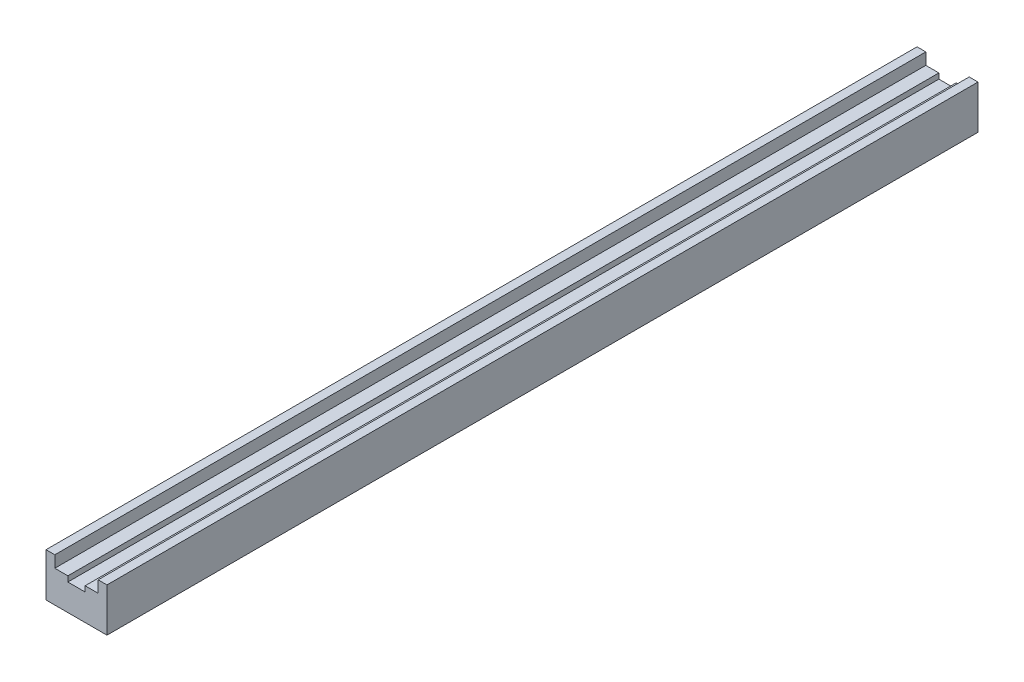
ISO-10303-21;
HEADER;
FILE_DESCRIPTION(('STEP AP214'),'2;1');
FILE_NAME('part.step','',(''),(''),'','','');
FILE_SCHEMA(('AUTOMOTIVE_DESIGN { 1 0 10303 214 1 1 1 1 }'));
ENDSEC;
DATA;
#1=APPLICATION_CONTEXT('core data for automotive mechanical design processes');
#2=APPLICATION_PROTOCOL_DEFINITION('international standard','automotive_design',2000,#1);
#3=PRODUCT_CONTEXT('',#1,'mechanical');
#4=PRODUCT('Part','Part','',(#3));
#5=PRODUCT_RELATED_PRODUCT_CATEGORY('part','',(#4));
#6=PRODUCT_DEFINITION_FORMATION('','',#4);
#7=PRODUCT_DEFINITION_CONTEXT('part definition',#1,'design');
#8=PRODUCT_DEFINITION('design','',#6,#7);
#9=PRODUCT_DEFINITION_SHAPE('','',#8);
#10=(LENGTH_UNIT() NAMED_UNIT(*) SI_UNIT(.MILLI.,.METRE.));
#11=(NAMED_UNIT(*) PLANE_ANGLE_UNIT() SI_UNIT($,.RADIAN.));
#12=(NAMED_UNIT(*) SI_UNIT($,.STERADIAN.) SOLID_ANGLE_UNIT());
#13=UNCERTAINTY_MEASURE_WITH_UNIT(LENGTH_MEASURE(1.E-05),#10,'distance_accuracy_value','');
#14=(GEOMETRIC_REPRESENTATION_CONTEXT(3) GLOBAL_UNCERTAINTY_ASSIGNED_CONTEXT((#13)) GLOBAL_UNIT_ASSIGNED_CONTEXT((#10,
#11,#12)) REPRESENTATION_CONTEXT('',''));
#15=CARTESIAN_POINT('',(0.,0.,0.));
#16=DIRECTION('',(0.,0.,1.));
#17=DIRECTION('',(1.,0.,0.));
#18=AXIS2_PLACEMENT_3D('',#15,#16,#17);
#19=CARTESIAN_POINT('',(-17.5,25.,0.));
#20=DIRECTION('',(-1.,0.,0.));
#21=DIRECTION('',(0.,0.,1.));
#22=AXIS2_PLACEMENT_3D('',#19,#20,#21);
#23=PLANE('',#22);
#24=DIRECTION('',(0.,0.,1.));
#25=VECTOR('',#24,1.);
#26=CARTESIAN_POINT('',(-17.5,25.,0.));
#27=LINE('',#26,#25);
#28=CARTESIAN_POINT('',(-17.5,25.,0.));
#29=VERTEX_POINT('',#28);
#30=CARTESIAN_POINT('',(-17.5,25.,500.));
#31=VERTEX_POINT('',#30);
#32=EDGE_CURVE('E9',#29,#31,#27,.T.);
#33=ORIENTED_EDGE('',*,*,#32,.F.);
#34=DIRECTION('',(0.,-1.,0.));
#35=VECTOR('',#34,1.);
#36=CARTESIAN_POINT('',(-17.5,25.,0.));
#37=LINE('',#36,#35);
#38=CARTESIAN_POINT('',(-17.5,0.,0.));
#39=VERTEX_POINT('',#38);
#40=EDGE_CURVE('E103',#29,#39,#37,.T.);
#41=ORIENTED_EDGE('',*,*,#40,.T.);
#42=DIRECTION('',(0.,0.,1.));
#43=VECTOR('',#42,1.);
#44=CARTESIAN_POINT('',(-17.5,0.,0.));
#45=LINE('',#44,#43);
#46=CARTESIAN_POINT('',(-17.5,0.,500.));
#47=VERTEX_POINT('',#46);
#48=EDGE_CURVE('E99',#39,#47,#45,.T.);
#49=ORIENTED_EDGE('',*,*,#48,.T.);
#50=DIRECTION('',(0.,-1.,0.));
#51=VECTOR('',#50,1.);
#52=CARTESIAN_POINT('',(-17.5,25.,500.));
#53=LINE('',#52,#51);
#54=EDGE_CURVE('E101',#31,#47,#53,.T.);
#55=ORIENTED_EDGE('',*,*,#54,.F.);
#56=EDGE_LOOP('',(#33,#41,#49,#55));
#57=FACE_BOUND('',#56,.T.);
#58=ADVANCED_FACE('F14',(#57),#23,.T.);
#59=CARTESIAN_POINT('',(-17.5,25.,0.));
#60=DIRECTION('',(0.,-1.,0.));
#61=DIRECTION('',(1.,0.,0.));
#62=AXIS2_PLACEMENT_3D('',#59,#60,#61);
#63=PLANE('',#62);
#64=DIRECTION('',(0.,0.,1.));
#65=VECTOR('',#64,1.);
#66=CARTESIAN_POINT('',(-12.45,25.,0.));
#67=LINE('',#66,#65);
#68=CARTESIAN_POINT('',(-12.45,25.,0.));
#69=VERTEX_POINT('',#68);
#70=CARTESIAN_POINT('',(-12.45,25.,500.));
#71=VERTEX_POINT('',#70);
#72=EDGE_CURVE('E22',#69,#71,#67,.T.);
#73=ORIENTED_EDGE('',*,*,#72,.F.);
#74=DIRECTION('',(1.,0.,0.));
#75=VECTOR('',#74,1.);
#76=CARTESIAN_POINT('',(-17.5,25.,0.));
#77=LINE('',#76,#75);
#78=EDGE_CURVE('E109',#29,#69,#77,.T.);
#79=ORIENTED_EDGE('',*,*,#78,.F.);
#80=ORIENTED_EDGE('',*,*,#32,.T.);
#81=DIRECTION('',(1.,0.,0.));
#82=VECTOR('',#81,1.);
#83=CARTESIAN_POINT('',(-17.5,25.,500.));
#84=LINE('',#83,#82);
#85=EDGE_CURVE('E118',#31,#71,#84,.T.);
#86=ORIENTED_EDGE('',*,*,#85,.T.);
#87=EDGE_LOOP('',(#73,#79,#80,#86));
#88=FACE_BOUND('',#87,.T.);
#89=ADVANCED_FACE('F16',(#88),#63,.F.);
#90=CARTESIAN_POINT('',(-12.45,25.,0.));
#91=DIRECTION('',(-1.,0.,0.));
#92=DIRECTION('',(0.,-1.,0.));
#93=AXIS2_PLACEMENT_3D('',#90,#91,#92);
#94=PLANE('',#93);
#95=DIRECTION('',(0.,0.,1.));
#96=VECTOR('',#95,1.);
#97=CARTESIAN_POINT('',(-12.45,18.3,0.));
#98=LINE('',#97,#96);
#99=CARTESIAN_POINT('',(-12.45,18.3,0.));
#100=VERTEX_POINT('',#99);
#101=CARTESIAN_POINT('',(-12.45,18.3,500.));
#102=VERTEX_POINT('',#101);
#103=EDGE_CURVE('E197',#100,#102,#98,.T.);
#104=ORIENTED_EDGE('',*,*,#103,.F.);
#105=DIRECTION('',(0.,-1.,0.));
#106=VECTOR('',#105,1.);
#107=CARTESIAN_POINT('',(-12.45,25.,0.));
#108=LINE('',#107,#106);
#109=EDGE_CURVE('E177',#69,#100,#108,.T.);
#110=ORIENTED_EDGE('',*,*,#109,.F.);
#111=ORIENTED_EDGE('',*,*,#72,.T.);
#112=DIRECTION('',(0.,-1.,0.));
#113=VECTOR('',#112,1.);
#114=CARTESIAN_POINT('',(-12.45,25.,500.));
#115=LINE('',#114,#113);
#116=EDGE_CURVE('E146',#71,#102,#115,.T.);
#117=ORIENTED_EDGE('',*,*,#116,.T.);
#118=EDGE_LOOP('',(#104,#110,#111,#117));
#119=FACE_BOUND('',#118,.T.);
#120=ADVANCED_FACE('F199',(#119),#94,.F.);
#121=CARTESIAN_POINT('',(-12.45,18.3,0.));
#122=DIRECTION('',(0.,-1.,0.));
#123=DIRECTION('',(0.,0.,-1.));
#124=AXIS2_PLACEMENT_3D('',#121,#122,#123);
#125=PLANE('',#124);
#126=DIRECTION('',(0.,0.,1.));
#127=VECTOR('',#126,1.);
#128=CARTESIAN_POINT('',(-4.95,18.3,0.));
#129=LINE('',#128,#127);
#130=CARTESIAN_POINT('',(-4.95,18.3,0.));
#131=VERTEX_POINT('',#130);
#132=CARTESIAN_POINT('',(-4.95,18.3,500.));
#133=VERTEX_POINT('',#132);
#134=EDGE_CURVE('E195',#131,#133,#129,.T.);
#135=ORIENTED_EDGE('',*,*,#134,.F.);
#136=DIRECTION('',(1.,0.,0.));
#137=VECTOR('',#136,1.);
#138=CARTESIAN_POINT('',(-12.45,18.3,0.));
#139=LINE('',#138,#137);
#140=EDGE_CURVE('E174',#100,#131,#139,.T.);
#141=ORIENTED_EDGE('',*,*,#140,.F.);
#142=ORIENTED_EDGE('',*,*,#103,.T.);
#143=DIRECTION('',(1.,0.,0.));
#144=VECTOR('',#143,1.);
#145=CARTESIAN_POINT('',(-12.45,18.3,500.));
#146=LINE('',#145,#144);
#147=EDGE_CURVE('E143',#102,#133,#146,.T.);
#148=ORIENTED_EDGE('',*,*,#147,.T.);
#149=EDGE_LOOP('',(#135,#141,#142,#148));
#150=FACE_BOUND('',#149,.T.);
#151=ADVANCED_FACE('F231',(#150),#125,.F.);
#152=CARTESIAN_POINT('',(-4.95,18.3,0.));
#153=DIRECTION('',(-1.,0.,0.));
#154=DIRECTION('',(0.,0.,1.));
#155=AXIS2_PLACEMENT_3D('',#152,#153,#154);
#156=PLANE('',#155);
#157=DIRECTION('',(0.,0.,1.));
#158=VECTOR('',#157,1.);
#159=CARTESIAN_POINT('',(-4.95,15.2,0.));
#160=LINE('',#159,#158);
#161=CARTESIAN_POINT('',(-4.95,15.2,0.));
#162=VERTEX_POINT('',#161);
#163=CARTESIAN_POINT('',(-4.95,15.2,500.));
#164=VERTEX_POINT('',#163);
#165=EDGE_CURVE('E193',#162,#164,#160,.T.);
#166=ORIENTED_EDGE('',*,*,#165,.F.);
#167=DIRECTION('',(0.,-1.,0.));
#168=VECTOR('',#167,1.);
#169=CARTESIAN_POINT('',(-4.95,18.3,0.));
#170=LINE('',#169,#168);
#171=EDGE_CURVE('E171',#131,#162,#170,.T.);
#172=ORIENTED_EDGE('',*,*,#171,.F.);
#173=ORIENTED_EDGE('',*,*,#134,.T.);
#174=DIRECTION('',(0.,-1.,0.));
#175=VECTOR('',#174,1.);
#176=CARTESIAN_POINT('',(-4.95,18.3,500.));
#177=LINE('',#176,#175);
#178=EDGE_CURVE('E140',#133,#164,#177,.T.);
#179=ORIENTED_EDGE('',*,*,#178,.T.);
#180=EDGE_LOOP('',(#166,#172,#173,#179));
#181=FACE_BOUND('',#180,.T.);
#182=ADVANCED_FACE('F229',(#181),#156,.F.);
#183=CARTESIAN_POINT('',(-4.95,15.2,0.));
#184=DIRECTION('',(0.,-1.,0.));
#185=DIRECTION('',(0.,0.,-1.));
#186=AXIS2_PLACEMENT_3D('',#183,#184,#185);
#187=PLANE('',#186);
#188=DIRECTION('',(0.,0.,1.));
#189=VECTOR('',#188,1.);
#190=CARTESIAN_POINT('',(4.95,15.2,0.));
#191=LINE('',#190,#189);
#192=CARTESIAN_POINT('',(4.95,15.2,0.));
#193=VERTEX_POINT('',#192);
#194=CARTESIAN_POINT('',(4.95,15.2,500.));
#195=VERTEX_POINT('',#194);
#196=EDGE_CURVE('E191',#193,#195,#191,.T.);
#197=ORIENTED_EDGE('',*,*,#196,.F.);
#198=DIRECTION('',(1.,0.,0.));
#199=VECTOR('',#198,1.);
#200=CARTESIAN_POINT('',(-4.95,15.2,0.));
#201=LINE('',#200,#199);
#202=EDGE_CURVE('E168',#162,#193,#201,.T.);
#203=ORIENTED_EDGE('',*,*,#202,.F.);
#204=ORIENTED_EDGE('',*,*,#165,.T.);
#205=DIRECTION('',(1.,0.,0.));
#206=VECTOR('',#205,1.);
#207=CARTESIAN_POINT('',(-4.95,15.2,500.));
#208=LINE('',#207,#206);
#209=EDGE_CURVE('E137',#164,#195,#208,.T.);
#210=ORIENTED_EDGE('',*,*,#209,.T.);
#211=EDGE_LOOP('',(#197,#203,#204,#210));
#212=FACE_BOUND('',#211,.T.);
#213=ADVANCED_FACE('F225',(#212),#187,.F.);
#214=CARTESIAN_POINT('',(4.95,18.3,0.));
#215=DIRECTION('',(-1.,0.,0.));
#216=DIRECTION('',(0.,0.,1.));
#217=AXIS2_PLACEMENT_3D('',#214,#215,#216);
#218=PLANE('',#217);
#219=DIRECTION('',(0.,0.,1.));
#220=VECTOR('',#219,1.);
#221=CARTESIAN_POINT('',(4.95,18.3,0.));
#222=LINE('',#221,#220);
#223=CARTESIAN_POINT('',(4.95,18.3,0.));
#224=VERTEX_POINT('',#223);
#225=CARTESIAN_POINT('',(4.95,18.3,500.));
#226=VERTEX_POINT('',#225);
#227=EDGE_CURVE('E189',#224,#226,#222,.T.);
#228=ORIENTED_EDGE('',*,*,#227,.F.);
#229=DIRECTION('',(0.,-1.,0.));
#230=VECTOR('',#229,1.);
#231=CARTESIAN_POINT('',(4.95,18.3,0.));
#232=LINE('',#231,#230);
#233=EDGE_CURVE('E165',#224,#193,#232,.T.);
#234=ORIENTED_EDGE('',*,*,#233,.T.);
#235=ORIENTED_EDGE('',*,*,#196,.T.);
#236=DIRECTION('',(0.,-1.,0.));
#237=VECTOR('',#236,1.);
#238=CARTESIAN_POINT('',(4.95,18.3,500.));
#239=LINE('',#238,#237);
#240=EDGE_CURVE('E134',#226,#195,#239,.T.);
#241=ORIENTED_EDGE('',*,*,#240,.F.);
#242=EDGE_LOOP('',(#228,#234,#235,#241));
#243=FACE_BOUND('',#242,.T.);
#244=ADVANCED_FACE('F222',(#243),#218,.T.);
#245=CARTESIAN_POINT('',(4.95,18.3,0.));
#246=DIRECTION('',(0.,-1.,0.));
#247=DIRECTION('',(1.,0.,0.));
#248=AXIS2_PLACEMENT_3D('',#245,#246,#247);
#249=PLANE('',#248);
#250=DIRECTION('',(0.,0.,1.));
#251=VECTOR('',#250,1.);
#252=CARTESIAN_POINT('',(12.45,18.3,0.));
#253=LINE('',#252,#251);
#254=CARTESIAN_POINT('',(12.45,18.3,0.));
#255=VERTEX_POINT('',#254);
#256=CARTESIAN_POINT('',(12.45,18.3,500.));
#257=VERTEX_POINT('',#256);
#258=EDGE_CURVE('E187',#255,#257,#253,.T.);
#259=ORIENTED_EDGE('',*,*,#258,.F.);
#260=DIRECTION('',(1.,0.,0.));
#261=VECTOR('',#260,1.);
#262=CARTESIAN_POINT('',(4.95,18.3,0.));
#263=LINE('',#262,#261);
#264=EDGE_CURVE('E162',#224,#255,#263,.T.);
#265=ORIENTED_EDGE('',*,*,#264,.F.);
#266=ORIENTED_EDGE('',*,*,#227,.T.);
#267=DIRECTION('',(1.,0.,0.));
#268=VECTOR('',#267,1.);
#269=CARTESIAN_POINT('',(4.95,18.3,500.));
#270=LINE('',#269,#268);
#271=EDGE_CURVE('E131',#226,#257,#270,.T.);
#272=ORIENTED_EDGE('',*,*,#271,.T.);
#273=EDGE_LOOP('',(#259,#265,#266,#272));
#274=FACE_BOUND('',#273,.T.);
#275=ADVANCED_FACE('F218',(#274),#249,.F.);
#276=CARTESIAN_POINT('',(12.45,25.,0.));
#277=DIRECTION('',(-1.,0.,0.));
#278=DIRECTION('',(0.,0.,1.));
#279=AXIS2_PLACEMENT_3D('',#276,#277,#278);
#280=PLANE('',#279);
#281=DIRECTION('',(0.,0.,1.));
#282=VECTOR('',#281,1.);
#283=CARTESIAN_POINT('',(12.45,25.,0.));
#284=LINE('',#283,#282);
#285=CARTESIAN_POINT('',(12.45,25.,0.));
#286=VERTEX_POINT('',#285);
#287=CARTESIAN_POINT('',(12.45,25.,500.));
#288=VERTEX_POINT('',#287);
#289=EDGE_CURVE('E185',#286,#288,#284,.T.);
#290=ORIENTED_EDGE('',*,*,#289,.F.);
#291=DIRECTION('',(0.,-1.,0.));
#292=VECTOR('',#291,1.);
#293=CARTESIAN_POINT('',(12.45,25.,0.));
#294=LINE('',#293,#292);
#295=EDGE_CURVE('E159',#286,#255,#294,.T.);
#296=ORIENTED_EDGE('',*,*,#295,.T.);
#297=ORIENTED_EDGE('',*,*,#258,.T.);
#298=DIRECTION('',(0.,-1.,0.));
#299=VECTOR('',#298,1.);
#300=CARTESIAN_POINT('',(12.45,25.,500.));
#301=LINE('',#300,#299);
#302=EDGE_CURVE('E128',#288,#257,#301,.T.);
#303=ORIENTED_EDGE('',*,*,#302,.F.);
#304=EDGE_LOOP('',(#290,#296,#297,#303));
#305=FACE_BOUND('',#304,.T.);
#306=ADVANCED_FACE('F214',(#305),#280,.T.);
#307=CARTESIAN_POINT('',(12.45,25.,0.));
#308=DIRECTION('',(0.,-1.,0.));
#309=DIRECTION('',(1.,0.,0.));
#310=AXIS2_PLACEMENT_3D('',#307,#308,#309);
#311=PLANE('',#310);
#312=DIRECTION('',(0.,0.,1.));
#313=VECTOR('',#312,1.);
#314=CARTESIAN_POINT('',(17.5,25.,0.));
#315=LINE('',#314,#313);
#316=CARTESIAN_POINT('',(17.5,25.,0.));
#317=VERTEX_POINT('',#316);
#318=CARTESIAN_POINT('',(17.5,25.,500.));
#319=VERTEX_POINT('',#318);
#320=EDGE_CURVE('E183',#317,#319,#315,.T.);
#321=ORIENTED_EDGE('',*,*,#320,.F.);
#322=DIRECTION('',(1.,0.,0.));
#323=VECTOR('',#322,1.);
#324=CARTESIAN_POINT('',(12.45,25.,0.));
#325=LINE('',#324,#323);
#326=EDGE_CURVE('E156',#286,#317,#325,.T.);
#327=ORIENTED_EDGE('',*,*,#326,.F.);
#328=ORIENTED_EDGE('',*,*,#289,.T.);
#329=DIRECTION('',(1.,0.,0.));
#330=VECTOR('',#329,1.);
#331=CARTESIAN_POINT('',(12.45,25.,500.));
#332=LINE('',#331,#330);
#333=EDGE_CURVE('E123',#288,#319,#332,.T.);
#334=ORIENTED_EDGE('',*,*,#333,.T.);
#335=EDGE_LOOP('',(#321,#327,#328,#334));
#336=FACE_BOUND('',#335,.T.);
#337=ADVANCED_FACE('F212',(#336),#311,.F.);
#338=CARTESIAN_POINT('',(17.5,25.,0.));
#339=DIRECTION('',(-1.,0.,0.));
#340=DIRECTION('',(0.,0.,1.));
#341=AXIS2_PLACEMENT_3D('',#338,#339,#340);
#342=PLANE('',#341);
#343=DIRECTION('',(0.,0.,1.));
#344=VECTOR('',#343,1.);
#345=CARTESIAN_POINT('',(17.5,0.,0.));
#346=LINE('',#345,#344);
#347=CARTESIAN_POINT('',(17.5,0.,0.));
#348=VERTEX_POINT('',#347);
#349=CARTESIAN_POINT('',(17.5,0.,500.));
#350=VERTEX_POINT('',#349);
#351=EDGE_CURVE('E108',#348,#350,#346,.T.);
#352=ORIENTED_EDGE('',*,*,#351,.F.);
#353=DIRECTION('',(0.,-1.,0.));
#354=VECTOR('',#353,1.);
#355=CARTESIAN_POINT('',(17.5,25.,0.));
#356=LINE('',#355,#354);
#357=EDGE_CURVE('E153',#317,#348,#356,.T.);
#358=ORIENTED_EDGE('',*,*,#357,.F.);
#359=ORIENTED_EDGE('',*,*,#320,.T.);
#360=DIRECTION('',(0.,-1.,0.));
#361=VECTOR('',#360,1.);
#362=CARTESIAN_POINT('',(17.5,25.,500.));
#363=LINE('',#362,#361);
#364=EDGE_CURVE('E121',#319,#350,#363,.T.);
#365=ORIENTED_EDGE('',*,*,#364,.T.);
#366=EDGE_LOOP('',(#352,#358,#359,#365));
#367=FACE_BOUND('',#366,.T.);
#368=ADVANCED_FACE('F208',(#367),#342,.F.);
#369=CARTESIAN_POINT('',(-17.5,0.,0.));
#370=DIRECTION('',(0.,-1.,0.));
#371=DIRECTION('',(0.,0.,-1.));
#372=AXIS2_PLACEMENT_3D('',#369,#370,#371);
#373=PLANE('',#372);
#374=DIRECTION('',(1.,0.,0.));
#375=VECTOR('',#374,1.);
#376=CARTESIAN_POINT('',(-17.5,0.,0.));
#377=LINE('',#376,#375);
#378=EDGE_CURVE('E151',#39,#348,#377,.T.);
#379=ORIENTED_EDGE('',*,*,#378,.T.);
#380=ORIENTED_EDGE('',*,*,#351,.T.);
#381=DIRECTION('',(1.,0.,0.));
#382=VECTOR('',#381,1.);
#383=CARTESIAN_POINT('',(-17.5,0.,500.));
#384=LINE('',#383,#382);
#385=EDGE_CURVE('E115',#47,#350,#384,.T.);
#386=ORIENTED_EDGE('',*,*,#385,.F.);
#387=ORIENTED_EDGE('',*,*,#48,.F.);
#388=EDGE_LOOP('',(#379,#380,#386,#387));
#389=FACE_BOUND('',#388,.T.);
#390=ADVANCED_FACE('F120',(#389),#373,.T.);
#391=CARTESIAN_POINT('',(-17.5,0.,0.));
#392=DIRECTION('',(0.,0.,1.));
#393=DIRECTION('',(1.,0.,0.));
#394=AXIS2_PLACEMENT_3D('',#391,#392,#393);
#395=PLANE('',#394);
#396=ORIENTED_EDGE('',*,*,#40,.F.);
#397=ORIENTED_EDGE('',*,*,#78,.T.);
#398=ORIENTED_EDGE('',*,*,#109,.T.);
#399=ORIENTED_EDGE('',*,*,#140,.T.);
#400=ORIENTED_EDGE('',*,*,#171,.T.);
#401=ORIENTED_EDGE('',*,*,#202,.T.);
#402=ORIENTED_EDGE('',*,*,#233,.F.);
#403=ORIENTED_EDGE('',*,*,#264,.T.);
#404=ORIENTED_EDGE('',*,*,#295,.F.);
#405=ORIENTED_EDGE('',*,*,#326,.T.);
#406=ORIENTED_EDGE('',*,*,#357,.T.);
#407=ORIENTED_EDGE('',*,*,#378,.F.);
#408=EDGE_LOOP('',(#396,#397,#398,#399,#400,#401,#402,#403,#404,#405,#406,#407));
#409=FACE_BOUND('',#408,.T.);
#410=ADVANCED_FACE('F203',(#409),#395,.F.);
#411=CARTESIAN_POINT('',(-17.5,0.,500.));
#412=DIRECTION('',(0.,0.,1.));
#413=DIRECTION('',(1.,0.,0.));
#414=AXIS2_PLACEMENT_3D('',#411,#412,#413);
#415=PLANE('',#414);
#416=ORIENTED_EDGE('',*,*,#54,.T.);
#417=ORIENTED_EDGE('',*,*,#385,.T.);
#418=ORIENTED_EDGE('',*,*,#364,.F.);
#419=ORIENTED_EDGE('',*,*,#333,.F.);
#420=ORIENTED_EDGE('',*,*,#302,.T.);
#421=ORIENTED_EDGE('',*,*,#271,.F.);
#422=ORIENTED_EDGE('',*,*,#240,.T.);
#423=ORIENTED_EDGE('',*,*,#209,.F.);
#424=ORIENTED_EDGE('',*,*,#178,.F.);
#425=ORIENTED_EDGE('',*,*,#147,.F.);
#426=ORIENTED_EDGE('',*,*,#116,.F.);
#427=ORIENTED_EDGE('',*,*,#85,.F.);
#428=EDGE_LOOP('',(#416,#417,#418,#419,#420,#421,#422,#423,#424,#425,#426,#427));
#429=FACE_BOUND('',#428,.T.);
#430=ADVANCED_FACE('F113',(#429),#415,.T.);
#431=CLOSED_SHELL('',(#58,#89,#120,#151,#182,#213,#244,#275,#306,#337,#368,#390,#410,#430));
#432=MANIFOLD_SOLID_BREP('B1',#431);
#433=ADVANCED_BREP_SHAPE_REPRESENTATION('',(#18,#432),#14);
#434=SHAPE_DEFINITION_REPRESENTATION(#9,#433);
ENDSEC;
END-ISO-10303-21;
